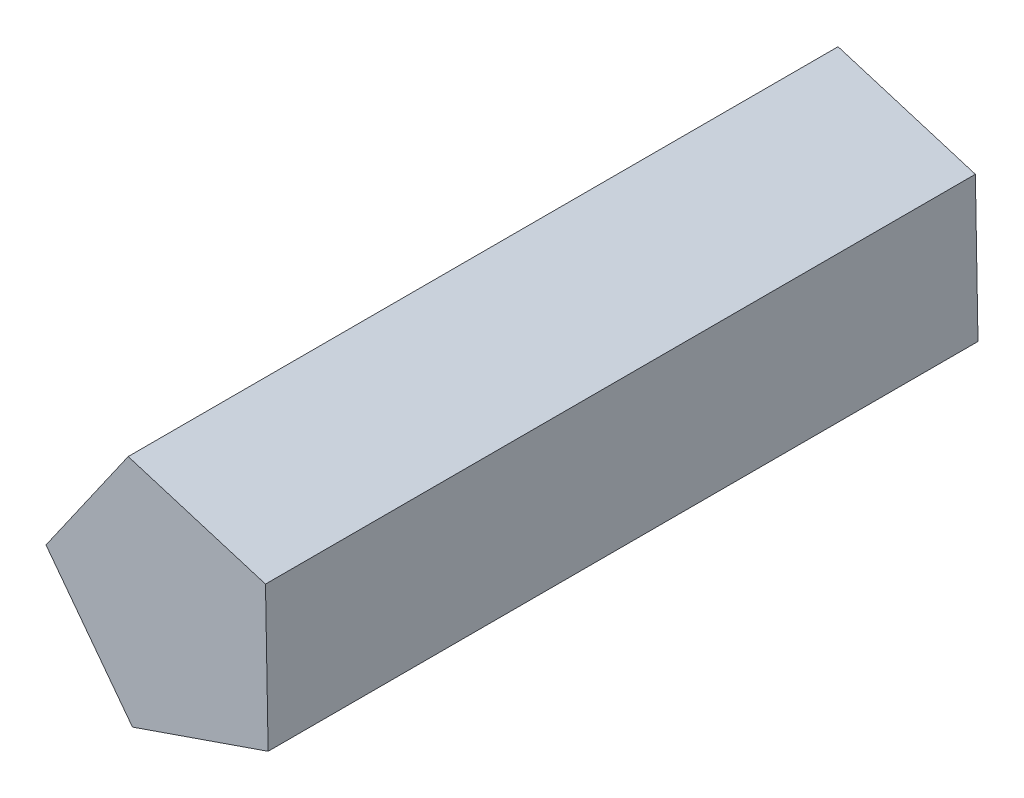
ISO-10303-21;
HEADER;
FILE_DESCRIPTION(('STEP AP214'),'2;1');
FILE_NAME('part.step','',(''),(''),'','','');
FILE_SCHEMA(('AUTOMOTIVE_DESIGN { 1 0 10303 214 1 1 1 1 }'));
ENDSEC;
DATA;
#1=APPLICATION_CONTEXT('core data for automotive mechanical design processes');
#2=APPLICATION_PROTOCOL_DEFINITION('international standard','automotive_design',2000,#1);
#3=PRODUCT_CONTEXT('',#1,'mechanical');
#4=PRODUCT('Part','Part','',(#3));
#5=PRODUCT_RELATED_PRODUCT_CATEGORY('part','',(#4));
#6=PRODUCT_DEFINITION_FORMATION('','',#4);
#7=PRODUCT_DEFINITION_CONTEXT('part definition',#1,'design');
#8=PRODUCT_DEFINITION('design','',#6,#7);
#9=PRODUCT_DEFINITION_SHAPE('','',#8);
#10=(LENGTH_UNIT() NAMED_UNIT(*) SI_UNIT(.MILLI.,.METRE.));
#11=(NAMED_UNIT(*) PLANE_ANGLE_UNIT() SI_UNIT($,.RADIAN.));
#12=(NAMED_UNIT(*) SI_UNIT($,.STERADIAN.) SOLID_ANGLE_UNIT());
#13=UNCERTAINTY_MEASURE_WITH_UNIT(LENGTH_MEASURE(1.E-05),#10,'distance_accuracy_value','');
#14=(GEOMETRIC_REPRESENTATION_CONTEXT(3) GLOBAL_UNCERTAINTY_ASSIGNED_CONTEXT((#13)) GLOBAL_UNIT_ASSIGNED_CONTEXT((#10,
#11,#12)) REPRESENTATION_CONTEXT('',''));
#15=CARTESIAN_POINT('',(0.,0.,0.));
#16=DIRECTION('',(0.,0.,1.));
#17=DIRECTION('',(1.,0.,0.));
#18=AXIS2_PLACEMENT_3D('',#15,#16,#17);
#19=CARTESIAN_POINT('',(10.6978864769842,-0.189584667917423,24.));
#20=DIRECTION('',(-0.326477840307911,0.945204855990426,0.));
#21=DIRECTION('',(-0.945204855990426,-0.326477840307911,0.));
#22=AXIS2_PLACEMENT_3D('',#19,#20,#21);
#23=PLANE('',#22);
#24=DIRECTION('',(0.945204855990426,0.326477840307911,0.));
#25=VECTOR('',#24,1.);
#26=CARTESIAN_POINT('',(10.6978864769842,-0.189584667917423,0.));
#27=LINE('',#26,#25);
#28=CARTESIAN_POINT('',(10.6978864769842,-0.189584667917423,0.));
#29=VERTEX_POINT('',#28);
#30=CARTESIAN_POINT('',(15.2842720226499,1.39457271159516,0.));
#31=VERTEX_POINT('',#30);
#32=EDGE_CURVE('E102',#29,#31,#27,.T.);
#33=ORIENTED_EDGE('',*,*,#32,.T.);
#34=DIRECTION('',(0.,0.,-1.));
#35=VECTOR('',#34,1.);
#36=CARTESIAN_POINT('',(15.2842720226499,1.39457271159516,24.));
#37=LINE('',#36,#35);
#38=CARTESIAN_POINT('',(15.2842720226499,1.39457271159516,24.));
#39=VERTEX_POINT('',#38);
#40=EDGE_CURVE('E11',#39,#31,#37,.T.);
#41=ORIENTED_EDGE('',*,*,#40,.F.);
#42=DIRECTION('',(0.945204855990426,0.326477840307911,0.));
#43=VECTOR('',#42,1.);
#44=CARTESIAN_POINT('',(10.6978864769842,-0.189584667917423,24.));
#45=LINE('',#44,#43);
#46=CARTESIAN_POINT('',(10.6978864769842,-0.189584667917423,24.));
#47=VERTEX_POINT('',#46);
#48=EDGE_CURVE('E116',#47,#39,#45,.T.);
#49=ORIENTED_EDGE('',*,*,#48,.F.);
#50=DIRECTION('',(0.,0.,-1.));
#51=VECTOR('',#50,1.);
#52=CARTESIAN_POINT('',(10.6978864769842,-0.189584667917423,24.));
#53=LINE('',#52,#51);
#54=EDGE_CURVE('E112',#47,#29,#53,.T.);
#55=ORIENTED_EDGE('',*,*,#54,.T.);
#56=EDGE_LOOP('',(#33,#41,#49,#55));
#57=FACE_BOUND('',#56,.T.);
#58=ADVANCED_FACE('F38',(#57),#23,.F.);
#59=CARTESIAN_POINT('',(15.2842720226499,1.39457271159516,24.));
#60=DIRECTION('',(-0.999830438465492,-0.0184145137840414,0.));
#61=DIRECTION('',(0.0184145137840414,-0.999830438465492,0.));
#62=AXIS2_PLACEMENT_3D('',#59,#60,#61);
#63=PLANE('',#62);
#64=DIRECTION('',(-0.0184145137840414,0.999830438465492,0.));
#65=VECTOR('',#64,1.);
#66=CARTESIAN_POINT('',(15.2842720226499,1.39457271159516,0.));
#67=LINE('',#66,#65);
#68=CARTESIAN_POINT('',(15.1949199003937,6.24601612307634,0.));
#69=VERTEX_POINT('',#68);
#70=EDGE_CURVE('E100',#31,#69,#67,.T.);
#71=ORIENTED_EDGE('',*,*,#70,.T.);
#72=DIRECTION('',(0.,0.,-1.));
#73=VECTOR('',#72,1.);
#74=CARTESIAN_POINT('',(15.1949199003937,6.24601612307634,24.));
#75=LINE('',#74,#73);
#76=CARTESIAN_POINT('',(15.1949199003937,6.24601612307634,24.));
#77=VERTEX_POINT('',#76);
#78=EDGE_CURVE('E48',#77,#69,#75,.T.);
#79=ORIENTED_EDGE('',*,*,#78,.F.);
#80=DIRECTION('',(-0.0184145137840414,0.999830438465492,0.));
#81=VECTOR('',#80,1.);
#82=CARTESIAN_POINT('',(15.2842720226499,1.39457271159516,24.));
#83=LINE('',#82,#81);
#84=EDGE_CURVE('E109',#39,#77,#83,.T.);
#85=ORIENTED_EDGE('',*,*,#84,.F.);
#86=ORIENTED_EDGE('',*,*,#40,.T.);
#87=EDGE_LOOP('',(#71,#79,#85,#86));
#88=FACE_BOUND('',#87,.T.);
#89=ADVANCED_FACE('F108',(#88),#63,.F.);
#90=CARTESIAN_POINT('',(15.1949199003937,6.24601612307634,24.));
#91=DIRECTION('',(-0.291451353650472,-0.956585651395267,0.));
#92=DIRECTION('',(0.956585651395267,-0.291451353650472,0.));
#93=AXIS2_PLACEMENT_3D('',#90,#91,#92);
#94=PLANE('',#93);
#95=DIRECTION('',(-0.956585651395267,0.291451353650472,0.));
#96=VECTOR('',#95,1.);
#97=CARTESIAN_POINT('',(15.1949199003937,6.24601612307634,0.));
#98=LINE('',#97,#96);
#99=CARTESIAN_POINT('',(10.5533117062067,7.66021566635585,0.));
#100=VERTEX_POINT('',#99);
#101=EDGE_CURVE('E90',#69,#100,#98,.T.);
#102=ORIENTED_EDGE('',*,*,#101,.T.);
#103=DIRECTION('',(0.,0.,-1.));
#104=VECTOR('',#103,1.);
#105=CARTESIAN_POINT('',(10.5533117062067,7.66021566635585,24.));
#106=LINE('',#105,#104);
#107=CARTESIAN_POINT('',(10.5533117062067,7.66021566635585,24.));
#108=VERTEX_POINT('',#107);
#109=EDGE_CURVE('E124',#108,#100,#106,.T.);
#110=ORIENTED_EDGE('',*,*,#109,.F.);
#111=DIRECTION('',(-0.956585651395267,0.291451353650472,0.));
#112=VECTOR('',#111,1.);
#113=CARTESIAN_POINT('',(15.1949199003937,6.24601612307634,24.));
#114=LINE('',#113,#112);
#115=EDGE_CURVE('E127',#77,#108,#114,.T.);
#116=ORIENTED_EDGE('',*,*,#115,.F.);
#117=ORIENTED_EDGE('',*,*,#78,.T.);
#118=EDGE_LOOP('',(#102,#110,#116,#117));
#119=FACE_BOUND('',#118,.T.);
#120=ADVANCED_FACE('F144',(#119),#94,.F.);
#121=CARTESIAN_POINT('',(10.5533117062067,7.66021566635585,24.));
#122=DIRECTION('',(0.819703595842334,-0.572787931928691,0.));
#123=DIRECTION('',(0.572787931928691,0.819703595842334,0.));
#124=AXIS2_PLACEMENT_3D('',#121,#122,#123);
#125=PLANE('',#124);
#126=DIRECTION('',(-0.572787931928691,-0.819703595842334,0.));
#127=VECTOR('',#126,1.);
#128=CARTESIAN_POINT('',(10.5533117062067,7.66021566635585,0.));
#129=LINE('',#128,#127);
#130=CARTESIAN_POINT('',(7.77399220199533,3.682795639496,0.));
#131=VERTEX_POINT('',#130);
#132=EDGE_CURVE('E82',#100,#131,#129,.T.);
#133=ORIENTED_EDGE('',*,*,#132,.T.);
#134=DIRECTION('',(0.,0.,-1.));
#135=VECTOR('',#134,1.);
#136=CARTESIAN_POINT('',(7.77399220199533,3.682795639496,24.));
#137=LINE('',#136,#135);
#138=CARTESIAN_POINT('',(7.77399220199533,3.682795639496,24.));
#139=VERTEX_POINT('',#138);
#140=EDGE_CURVE('E120',#139,#131,#137,.T.);
#141=ORIENTED_EDGE('',*,*,#140,.F.);
#142=DIRECTION('',(-0.572787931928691,-0.819703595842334,0.));
#143=VECTOR('',#142,1.);
#144=CARTESIAN_POINT('',(10.5533117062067,7.66021566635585,24.));
#145=LINE('',#144,#143);
#146=EDGE_CURVE('E61',#108,#139,#145,.T.);
#147=ORIENTED_EDGE('',*,*,#146,.F.);
#148=ORIENTED_EDGE('',*,*,#109,.T.);
#149=EDGE_LOOP('',(#133,#141,#147,#148));
#150=FACE_BOUND('',#149,.T.);
#151=ADVANCED_FACE('F142',(#150),#125,.F.);
#152=CARTESIAN_POINT('',(7.77399220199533,3.682795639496,24.));
#153=DIRECTION('',(0.798056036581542,0.602583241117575,0.));
#154=DIRECTION('',(-0.602583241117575,0.798056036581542,0.));
#155=AXIS2_PLACEMENT_3D('',#152,#153,#154);
#156=PLANE('',#155);
#157=DIRECTION('',(0.602583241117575,-0.798056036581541,0.));
#158=VECTOR('',#157,1.);
#159=CARTESIAN_POINT('',(7.77399220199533,3.682795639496,0.));
#160=LINE('',#159,#158);
#161=EDGE_CURVE('E73',#131,#29,#160,.T.);
#162=ORIENTED_EDGE('',*,*,#161,.T.);
#163=ORIENTED_EDGE('',*,*,#54,.F.);
#164=DIRECTION('',(0.602583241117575,-0.798056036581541,0.));
#165=VECTOR('',#164,1.);
#166=CARTESIAN_POINT('',(7.77399220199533,3.682795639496,24.));
#167=LINE('',#166,#165);
#168=EDGE_CURVE('E42',#139,#47,#167,.T.);
#169=ORIENTED_EDGE('',*,*,#168,.F.);
#170=ORIENTED_EDGE('',*,*,#140,.T.);
#171=EDGE_LOOP('',(#162,#163,#169,#170));
#172=FACE_BOUND('',#171,.T.);
#173=ADVANCED_FACE('F141',(#172),#156,.F.);
#174=CARTESIAN_POINT('',(-6.80050083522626,-2.14788748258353,24.));
#175=DIRECTION('',(0.,0.,1.));
#176=DIRECTION('',(1.,0.,0.));
#177=AXIS2_PLACEMENT_3D('',#174,#175,#176);
#178=PLANE('',#177);
#179=ORIENTED_EDGE('',*,*,#48,.T.);
#180=ORIENTED_EDGE('',*,*,#84,.T.);
#181=ORIENTED_EDGE('',*,*,#115,.T.);
#182=ORIENTED_EDGE('',*,*,#146,.T.);
#183=ORIENTED_EDGE('',*,*,#168,.T.);
#184=EDGE_LOOP('',(#179,#180,#181,#182,#183));
#185=FACE_BOUND('',#184,.T.);
#186=ADVANCED_FACE('F145',(#185),#178,.T.);
#187=CARTESIAN_POINT('',(-6.80050083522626,-2.14788748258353,0.));
#188=DIRECTION('',(0.,0.,1.));
#189=DIRECTION('',(1.,0.,0.));
#190=AXIS2_PLACEMENT_3D('',#187,#188,#189);
#191=PLANE('',#190);
#192=ORIENTED_EDGE('',*,*,#32,.F.);
#193=ORIENTED_EDGE('',*,*,#161,.F.);
#194=ORIENTED_EDGE('',*,*,#132,.F.);
#195=ORIENTED_EDGE('',*,*,#101,.F.);
#196=ORIENTED_EDGE('',*,*,#70,.F.);
#197=EDGE_LOOP('',(#192,#193,#194,#195,#196));
#198=FACE_BOUND('',#197,.T.);
#199=ADVANCED_FACE('F40',(#198),#191,.F.);
#200=CLOSED_SHELL('',(#58,#89,#120,#151,#173,#186,#199));
#201=MANIFOLD_SOLID_BREP('B2',#200);
#202=ADVANCED_BREP_SHAPE_REPRESENTATION('',(#18,#201),#14);
#203=SHAPE_DEFINITION_REPRESENTATION(#9,#202);
ENDSEC;
END-ISO-10303-21;
